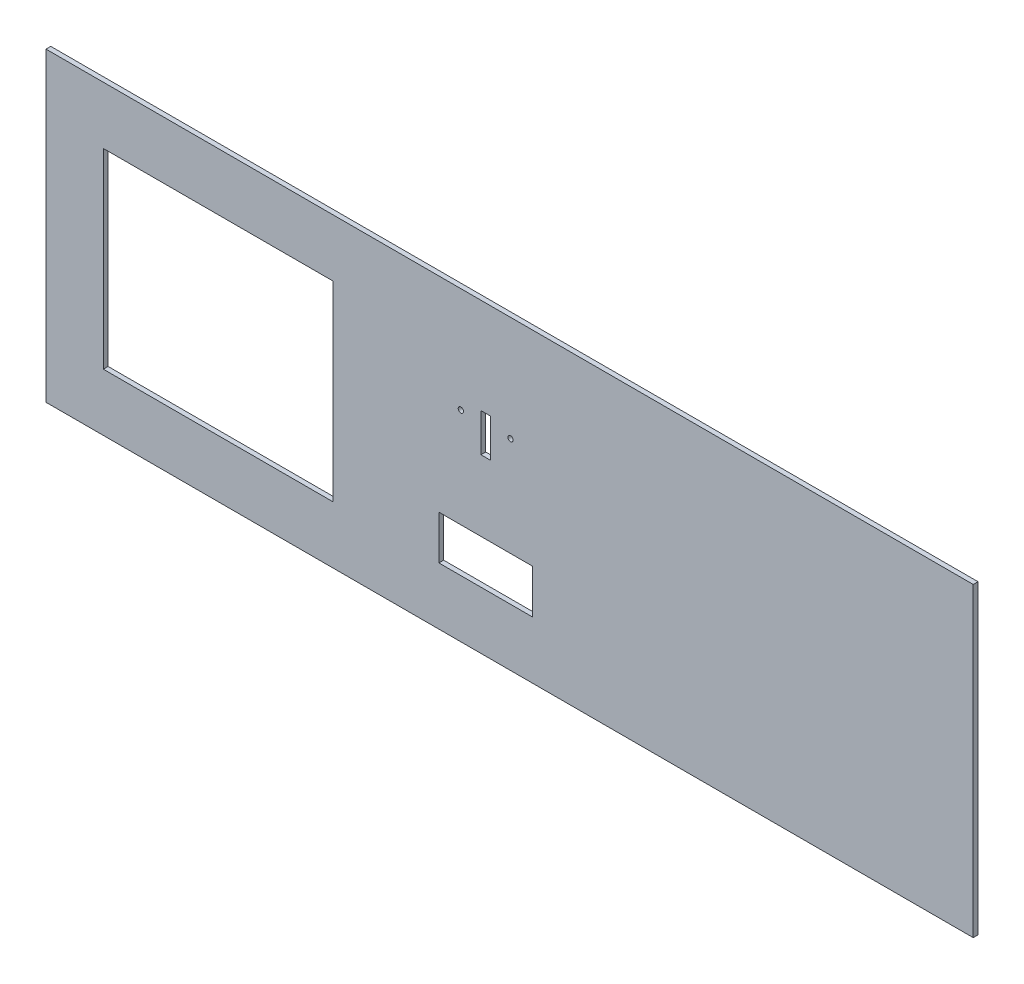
from build123d import *

# Parameters (mm, degrees)
SKETCH1_W           = 615.95
SKETCH1_H           = 203.2
BOSS_EXTRUDE1_DEPTH = 3.175
SKETCH2_W           = 152.4
SKETCH2_H           = 127
CUT_EXTRUDE1_DEPTH  = 325.316575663
SKETCH3_W           = 6.35
SKETCH3_H           = 25.4
CUT_EXTRUDE2_DEPTH  = 325.316575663
SKETCH4_R           = 1.75
CUT_EXTRUDE3_DEPTH  = 325.316575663
SKETCH5_W           = 62.23
SKETCH5_H           = 29.21
CUT_EXTRUDE4_DEPTH  = 325.316575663


with BuildPart() as part:
    # Sketch1 → Boss-Extrude1 (new body)
    with BuildSketch(Plane.XY):
        Rectangle(SKETCH1_W, SKETCH1_H)
    extrude(amount=BOSS_EXTRUDE1_DEPTH)

    # Sketch2 → Cut-Extrude1 (cut, through all)
    with BuildSketch(Plane.XY.offset(3.175)):
        with Locations((-193.675, 0)):
            Rectangle(SKETCH2_W, SKETCH2_H)
    extrude(amount=-CUT_EXTRUDE1_DEPTH, mode=Mode.SUBTRACT)

    # Sketch3 → Cut-Extrude2 (cut, through all)
    with BuildSketch(Plane.XY.offset(3.175)):
        with Locations((-15.875, 25.4)):
            Rectangle(SKETCH3_W, SKETCH3_H)
    extrude(amount=-CUT_EXTRUDE2_DEPTH, mode=Mode.SUBTRACT)

    # Sketch4 → Cut-Extrude3 (cut, through all)
    with BuildSketch(Plane.XY.offset(3.175)):
        with Locations((0.635, 31.75)):
            Circle(SKETCH4_R)
        with Locations(Location((-32.385, 31.75, 0), (0, 0, 180))):
            Circle(SKETCH4_R)
    extrude(amount=-CUT_EXTRUDE3_DEPTH, mode=Mode.SUBTRACT)

    # Sketch5 → Cut-Extrude4 (cut, through all)
    with BuildSketch(Plane.XY.offset(3.175)):
        with Locations((-15.875, -48.895)):
            Rectangle(SKETCH5_W, SKETCH5_H)
    extrude(amount=-CUT_EXTRUDE4_DEPTH, mode=Mode.SUBTRACT)


solid = part.part
